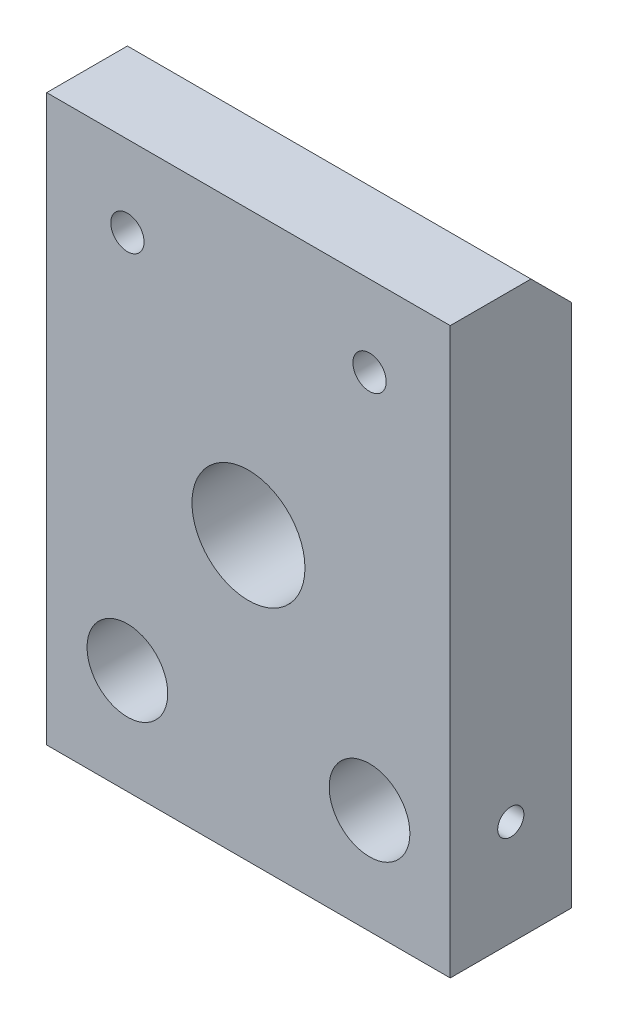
ISO-10303-21;
HEADER;
FILE_DESCRIPTION(('STEP AP214'),'2;1');
FILE_NAME('part.step','',(''),(''),'','','');
FILE_SCHEMA(('AUTOMOTIVE_DESIGN { 1 0 10303 214 1 1 1 1 }'));
ENDSEC;
DATA;
#1=APPLICATION_CONTEXT('core data for automotive mechanical design processes');
#2=APPLICATION_PROTOCOL_DEFINITION('international standard','automotive_design',2000,#1);
#3=PRODUCT_CONTEXT('',#1,'mechanical');
#4=PRODUCT('Part','Part','',(#3));
#5=PRODUCT_RELATED_PRODUCT_CATEGORY('part','',(#4));
#6=PRODUCT_DEFINITION_FORMATION('','',#4);
#7=PRODUCT_DEFINITION_CONTEXT('part definition',#1,'design');
#8=PRODUCT_DEFINITION('design','',#6,#7);
#9=PRODUCT_DEFINITION_SHAPE('','',#8);
#10=(LENGTH_UNIT() NAMED_UNIT(*) SI_UNIT(.MILLI.,.METRE.));
#11=(NAMED_UNIT(*) PLANE_ANGLE_UNIT() SI_UNIT($,.RADIAN.));
#12=(NAMED_UNIT(*) SI_UNIT($,.STERADIAN.) SOLID_ANGLE_UNIT());
#13=UNCERTAINTY_MEASURE_WITH_UNIT(LENGTH_MEASURE(1.E-05),#10,'distance_accuracy_value','');
#14=(GEOMETRIC_REPRESENTATION_CONTEXT(3) GLOBAL_UNCERTAINTY_ASSIGNED_CONTEXT((#13)) GLOBAL_UNIT_ASSIGNED_CONTEXT((#10,
#11,#12)) REPRESENTATION_CONTEXT('',''));
#15=CARTESIAN_POINT('',(0.,0.,0.));
#16=DIRECTION('',(0.,0.,1.));
#17=DIRECTION('',(1.,0.,0.));
#18=AXIS2_PLACEMENT_3D('',#15,#16,#17);
#19=CARTESIAN_POINT('',(-25.,0.,15.));
#20=DIRECTION('',(-1.,0.,0.));
#21=DIRECTION('',(0.,0.,1.));
#22=AXIS2_PLACEMENT_3D('',#19,#20,#21);
#23=PLANE('',#22);
#24=DIRECTION('',(0.,0.,-1.));
#25=VECTOR('',#24,1.);
#26=CARTESIAN_POINT('',(-25.,70.,15.));
#27=LINE('',#26,#25);
#28=CARTESIAN_POINT('',(-25.,70.,15.));
#29=VERTEX_POINT('',#28);
#30=CARTESIAN_POINT('',(-25.,70.,5.00000000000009));
#31=VERTEX_POINT('',#30);
#32=EDGE_CURVE('E84',#29,#31,#27,.T.);
#33=ORIENTED_EDGE('',*,*,#32,.T.);
#34=DIRECTION('',(0.,0.707106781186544,0.707106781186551));
#35=VECTOR('',#34,1.);
#36=CARTESIAN_POINT('',(-25.,40.0000000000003,-24.9999999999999));
#37=LINE('',#36,#35);
#38=CARTESIAN_POINT('',(-25.,65.,0.));
#39=VERTEX_POINT('',#38);
#40=EDGE_CURVE('E51',#31,#39,#37,.F.);
#41=ORIENTED_EDGE('',*,*,#40,.T.);
#42=DIRECTION('',(0.,1.,0.));
#43=VECTOR('',#42,1.);
#44=CARTESIAN_POINT('',(-25.,0.,0.));
#45=LINE('',#44,#43);
#46=CARTESIAN_POINT('',(-25.,0.,0.));
#47=VERTEX_POINT('',#46);
#48=EDGE_CURVE('E89',#47,#39,#45,.T.);
#49=ORIENTED_EDGE('',*,*,#48,.F.);
#50=DIRECTION('',(0.,0.,-1.));
#51=VECTOR('',#50,1.);
#52=CARTESIAN_POINT('',(-25.,0.,15.));
#53=LINE('',#52,#51);
#54=CARTESIAN_POINT('',(-25.,0.,15.));
#55=VERTEX_POINT('',#54);
#56=EDGE_CURVE('E75',#55,#47,#53,.T.);
#57=ORIENTED_EDGE('',*,*,#56,.F.);
#58=DIRECTION('',(0.,1.,0.));
#59=VECTOR('',#58,1.);
#60=CARTESIAN_POINT('',(-25.,0.,15.));
#61=LINE('',#60,#59);
#62=EDGE_CURVE('E103',#55,#29,#61,.T.);
#63=ORIENTED_EDGE('',*,*,#62,.T.);
#64=EDGE_LOOP('',(#33,#41,#49,#57,#63));
#65=FACE_BOUND('',#64,.T.);
#66=CARTESIAN_POINT('',(-25.,13.,7.5));
#67=DIRECTION('',(1.,0.,0.));
#68=DIRECTION('',(0.,0.,-1.));
#69=AXIS2_PLACEMENT_3D('',#66,#67,#68);
#70=CIRCLE('',#69,1.62);
#71=CARTESIAN_POINT('',(-25.,13.,5.88));
#72=VERTEX_POINT('',#71);
#73=EDGE_CURVE('E175',#72,#72,#70,.T.);
#74=ORIENTED_EDGE('',*,*,#73,.T.);
#75=EDGE_LOOP('',(#74));
#76=FACE_BOUND('',#75,.T.);
#77=ADVANCED_FACE('F29',(#65,#76),#23,.T.);
#78=CARTESIAN_POINT('',(-15.,13.,15.));
#79=DIRECTION('',(0.,0.,-1.));
#80=DIRECTION('',(-1.,0.,0.));
#81=AXIS2_PLACEMENT_3D('',#78,#79,#80);
#82=CYLINDRICAL_SURFACE('',#81,5.);
#83=CARTESIAN_POINT('',(-15.,13.,0.));
#84=DIRECTION('',(0.,0.,-1.));
#85=DIRECTION('',(-1.,0.,0.));
#86=AXIS2_PLACEMENT_3D('',#83,#84,#85);
#87=CIRCLE('',#86,5.);
#88=CARTESIAN_POINT('',(-20.,13.,0.));
#89=VERTEX_POINT('',#88);
#90=EDGE_CURVE('E195',#89,#89,#87,.T.);
#91=ORIENTED_EDGE('',*,*,#90,.T.);
#92=EDGE_LOOP('',(#91));
#93=FACE_BOUND('',#92,.T.);
#94=CARTESIAN_POINT('',(-15.,13.,15.));
#95=DIRECTION('',(0.,0.,-1.));
#96=DIRECTION('',(-1.,0.,0.));
#97=AXIS2_PLACEMENT_3D('',#94,#95,#96);
#98=CIRCLE('',#97,5.);
#99=CARTESIAN_POINT('',(-20.,13.,15.));
#100=VERTEX_POINT('',#99);
#101=EDGE_CURVE('E198',#100,#100,#98,.T.);
#102=ORIENTED_EDGE('',*,*,#101,.F.);
#103=EDGE_LOOP('',(#102));
#104=FACE_BOUND('',#103,.T.);
#105=CARTESIAN_POINT('',(-20.,13.,9.12));
#106=CARTESIAN_POINT('',(-19.9999999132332,13.0885311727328,9.11999994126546));
#107=CARTESIAN_POINT('',(-19.9976267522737,13.1770637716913,9.11271905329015));
#108=CARTESIAN_POINT('',(-19.9883929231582,13.3515296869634,9.08387115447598));
#109=CARTESIAN_POINT('',(-19.981531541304,13.4374625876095,9.06230187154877));
#110=CARTESIAN_POINT('',(-19.9640686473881,13.6041884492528,9.0056882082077));
#111=CARTESIAN_POINT('',(-19.9534731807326,13.684989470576,8.97066560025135));
#112=CARTESIAN_POINT('',(-19.9296292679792,13.8395714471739,8.8882352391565));
#113=CARTESIAN_POINT('',(-19.9163803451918,13.9133511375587,8.84082526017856));
#114=CARTESIAN_POINT('',(-19.8881412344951,14.0542263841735,8.73332419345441));
#115=CARTESIAN_POINT('',(-19.8731110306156,14.1210584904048,8.6728984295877));
#116=CARTESIAN_POINT('',(-19.8432287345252,14.2438393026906,8.54179306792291));
#117=CARTESIAN_POINT('',(-19.8283766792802,14.2997857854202,8.47111138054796));
#118=CARTESIAN_POINT('',(-19.8000969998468,14.400676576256,8.31917035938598));
#119=CARTESIAN_POINT('',(-19.7867184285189,14.4452845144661,8.23767766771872));
#120=CARTESIAN_POINT('',(-19.763505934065,14.5200509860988,8.06784344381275));
#121=CARTESIAN_POINT('',(-19.7536709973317,14.5502136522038,7.97950387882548));
#122=CARTESIAN_POINT('',(-19.7390794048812,14.5942560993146,7.80146921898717));
#123=CARTESIAN_POINT('',(-19.7341699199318,14.6086273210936,7.71190858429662));
#124=CARTESIAN_POINT('',(-19.7295322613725,14.6222148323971,7.53152309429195));
#125=CARTESIAN_POINT('',(-19.7298025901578,14.6214355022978,7.44069861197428));
#126=CARTESIAN_POINT('',(-19.7353596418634,14.6051268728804,7.2644966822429));
#127=CARTESIAN_POINT('',(-19.7404308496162,14.5902312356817,7.17905262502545));
#128=CARTESIAN_POINT('',(-19.7546667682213,14.547143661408,7.01194876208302));
#129=CARTESIAN_POINT('',(-19.7638319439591,14.5189502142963,6.93028938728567));
#130=CARTESIAN_POINT('',(-19.7853819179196,14.4496377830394,6.77160155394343));
#131=CARTESIAN_POINT('',(-19.797814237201,14.4083259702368,6.69466405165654));
#132=CARTESIAN_POINT('',(-19.8244769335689,14.3140833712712,6.54860962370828));
#133=CARTESIAN_POINT('',(-19.8387078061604,14.2611493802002,6.47949486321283));
#134=CARTESIAN_POINT('',(-19.8682196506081,14.1420916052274,6.3474771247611));
#135=CARTESIAN_POINT('',(-19.8835178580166,14.0754474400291,6.28504638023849));
#136=CARTESIAN_POINT('',(-19.9128265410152,13.9324460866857,6.17212771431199));
#137=CARTESIAN_POINT('',(-19.9268369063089,13.8560880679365,6.12164081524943));
#138=CARTESIAN_POINT('',(-19.9521579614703,13.6948667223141,6.03369051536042));
#139=CARTESIAN_POINT('',(-19.9634434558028,13.6099336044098,5.99634729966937));
#140=CARTESIAN_POINT('',(-19.9818608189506,13.4345389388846,5.93662203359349));
#141=CARTESIAN_POINT('',(-19.9889940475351,13.3440792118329,5.9142350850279));
#142=CARTESIAN_POINT('',(-19.9980808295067,13.1642017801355,5.88587976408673));
#143=CARTESIAN_POINT('',(-20.0002357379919,13.0748947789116,5.87927275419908));
#144=CARTESIAN_POINT('',(-19.999723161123,12.8964343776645,5.88085410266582));
#145=CARTESIAN_POINT('',(-19.9970564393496,12.8072809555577,5.88904011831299));
#146=CARTESIAN_POINT('',(-19.9873329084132,12.634172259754,5.91946633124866));
#147=CARTESIAN_POINT('',(-19.9803969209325,12.5501416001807,5.94131999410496));
#148=CARTESIAN_POINT('',(-19.9629558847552,12.3869684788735,5.99798318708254));
#149=CARTESIAN_POINT('',(-19.9524503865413,12.3078266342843,6.03279434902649));
#150=CARTESIAN_POINT('',(-19.9286102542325,12.1544332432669,6.1153711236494));
#151=CARTESIAN_POINT('',(-19.91521038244,12.0803575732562,6.16344407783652));
#152=CARTESIAN_POINT('',(-19.8871069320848,11.9411138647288,6.27081534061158));
#153=CARTESIAN_POINT('',(-19.8724029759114,11.8759484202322,6.33011690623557));
#154=CARTESIAN_POINT('',(-19.8425535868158,11.7534764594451,6.46126643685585));
#155=CARTESIAN_POINT('',(-19.8274161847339,11.6966255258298,6.5335426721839));
#156=CARTESIAN_POINT('',(-19.7990626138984,11.5958098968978,6.68693658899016));
#157=CARTESIAN_POINT('',(-19.7858464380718,11.5518451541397,6.76805423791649));
#158=CARTESIAN_POINT('',(-19.7629699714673,11.4782886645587,6.93676432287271));
#159=CARTESIAN_POINT('',(-19.7532992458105,11.4486546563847,7.0243368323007));
#160=CARTESIAN_POINT('',(-19.7387218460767,11.404674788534,7.20361108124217));
#161=CARTESIAN_POINT('',(-19.7338131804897,11.3903225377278,7.2953110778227));
#162=CARTESIAN_POINT('',(-19.7295336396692,11.3777945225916,7.47544545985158));
#163=CARTESIAN_POINT('',(-19.7299052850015,11.3788666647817,7.56382203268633));
#164=CARTESIAN_POINT('',(-19.7355129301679,11.395322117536,7.73906736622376));
#165=CARTESIAN_POINT('',(-19.7407486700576,11.410704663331,7.82593620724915));
#166=CARTESIAN_POINT('',(-19.755308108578,11.4548247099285,7.99424423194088));
#167=CARTESIAN_POINT('',(-19.7645610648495,11.4833315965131,8.07575045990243));
#168=CARTESIAN_POINT('',(-19.7860898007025,11.5527068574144,8.23288698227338));
#169=CARTESIAN_POINT('',(-19.798366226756,11.5935778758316,8.30851601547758));
#170=CARTESIAN_POINT('',(-19.8251957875,11.6885079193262,8.45516055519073));
#171=CARTESIAN_POINT('',(-19.8398224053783,11.7430449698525,8.52585310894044));
#172=CARTESIAN_POINT('',(-19.8693831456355,11.8629359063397,8.6573263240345));
#173=CARTESIAN_POINT('',(-19.8843173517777,11.9282927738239,8.71810424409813));
#174=CARTESIAN_POINT('',(-19.9134565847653,12.0707994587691,8.83022426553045));
#175=CARTESIAN_POINT('',(-19.9276159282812,12.1482894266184,8.88114731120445));
#176=CARTESIAN_POINT('',(-19.9530107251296,12.3111856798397,8.96918303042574));
#177=CARTESIAN_POINT('',(-19.9642471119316,12.3965894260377,9.0063001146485));
#178=CARTESIAN_POINT('',(-19.9819387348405,12.5673516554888,9.06358847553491));
#179=CARTESIAN_POINT('',(-19.9886500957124,12.6523755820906,9.08467823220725));
#180=CARTESIAN_POINT('',(-19.997680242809,12.824932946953,9.1128823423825));
#181=CARTESIAN_POINT('',(-20.0000000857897,12.912465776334,9.12000005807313));
#182=CARTESIAN_POINT('',(-20.,13.,9.12));
#183=B_SPLINE_CURVE_WITH_KNOTS('',3,(#105,#106,#107,#108,#109,#110,#111,#112,#113,#114,#115,
#116,#117,#118,#119,#120,#121,#122,#123,#124,#125,#126,#127,#128,#129,#130,#131,#132,#133,#134,
#135,#136,#137,#138,#139,#140,#141,#142,#143,#144,#145,#146,#147,#148,#149,#150,#151,#152,#153,
#154,#155,#156,#157,#158,#159,#160,#161,#162,#163,#164,#165,#166,#167,#168,#169,#170,#171,#172,
#173,#174,#175,#176,#177,#178,#179,#180,#181,#182),.UNSPECIFIED.,.T.,.F.,(4,2,2,2,2,2,2,2,2,2,2,
2,2,2,2,2,2,2,2,2,2,2,2,2,2,2,2,2,2,2,2,2,2,2,2,2,2,2,4),(0.,0.265271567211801,
0.530585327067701,0.795471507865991,1.06040531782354,1.33320409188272,1.60605852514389,
1.88625133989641,2.16636394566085,2.43748805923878,2.70853378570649,2.96796163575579,
3.22741895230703,3.49088184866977,3.75441748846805,4.03090513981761,4.30741644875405,
4.58639420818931,4.86528055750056,5.13267310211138,5.40002330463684,5.66013469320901,
5.92027885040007,6.18704828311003,6.45389521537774,6.73216017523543,7.01042411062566,
7.28786236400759,7.56518454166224,7.82903231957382,8.09286599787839,8.35223096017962,
8.61165142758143,8.88186734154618,9.15215784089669,9.43219049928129,9.71213361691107,
9.97448110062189,10.2367654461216),.UNSPECIFIED.);
#184=CARTESIAN_POINT('',(-20.,13.,9.12));
#185=VERTEX_POINT('',#184);
#186=EDGE_CURVE('E310',#185,#185,#183,.T.);
#187=ORIENTED_EDGE('',*,*,#186,.T.);
#188=EDGE_LOOP('',(#187));
#189=FACE_BOUND('',#188,.T.);
#190=ADVANCED_FACE('F143',(#93,#104,#189),#82,.F.);
#191=CARTESIAN_POINT('',(25.,70.,15.));
#192=DIRECTION('',(0.,0.,1.));
#193=DIRECTION('',(1.,0.,0.));
#194=AXIS2_PLACEMENT_3D('',#191,#192,#193);
#195=PLANE('',#194);
#196=CARTESIAN_POINT('',(15.,60.,15.));
#197=DIRECTION('',(0.,0.,-1.));
#198=DIRECTION('',(-1.,0.,0.));
#199=AXIS2_PLACEMENT_3D('',#196,#197,#198);
#200=CIRCLE('',#199,2.065);
#201=CARTESIAN_POINT('',(12.935,60.,15.));
#202=VERTEX_POINT('',#201);
#203=EDGE_CURVE('E172',#202,#202,#200,.T.);
#204=ORIENTED_EDGE('',*,*,#203,.T.);
#205=EDGE_LOOP('',(#204));
#206=FACE_BOUND('',#205,.T.);
#207=CARTESIAN_POINT('',(0.,35.,15.));
#208=DIRECTION('',(0.,0.,1.));
#209=DIRECTION('',(1.,0.,0.));
#210=AXIS2_PLACEMENT_3D('',#207,#208,#209);
#211=CIRCLE('',#210,7.);
#212=CARTESIAN_POINT('',(7.,35.,15.));
#213=VERTEX_POINT('',#212);
#214=EDGE_CURVE('E192',#213,#213,#211,.T.);
#215=ORIENTED_EDGE('',*,*,#214,.F.);
#216=EDGE_LOOP('',(#215));
#217=FACE_BOUND('',#216,.T.);
#218=ORIENTED_EDGE('',*,*,#101,.T.);
#219=EDGE_LOOP('',(#218));
#220=FACE_BOUND('',#219,.T.);
#221=DIRECTION('',(0.,1.,0.));
#222=VECTOR('',#221,1.);
#223=CARTESIAN_POINT('',(25.,0.,15.));
#224=LINE('',#223,#222);
#225=CARTESIAN_POINT('',(25.,0.,15.));
#226=VERTEX_POINT('',#225);
#227=CARTESIAN_POINT('',(25.,70.,15.));
#228=VERTEX_POINT('',#227);
#229=EDGE_CURVE('E91',#226,#228,#224,.T.);
#230=ORIENTED_EDGE('',*,*,#229,.T.);
#231=DIRECTION('',(-1.,0.,0.));
#232=VECTOR('',#231,1.);
#233=CARTESIAN_POINT('',(25.,70.,15.));
#234=LINE('',#233,#232);
#235=EDGE_CURVE('E101',#228,#29,#234,.T.);
#236=ORIENTED_EDGE('',*,*,#235,.T.);
#237=ORIENTED_EDGE('',*,*,#62,.F.);
#238=DIRECTION('',(1.,0.,0.));
#239=VECTOR('',#238,1.);
#240=CARTESIAN_POINT('',(-25.,0.,15.));
#241=LINE('',#240,#239);
#242=EDGE_CURVE('E81',#55,#226,#241,.T.);
#243=ORIENTED_EDGE('',*,*,#242,.T.);
#244=EDGE_LOOP('',(#230,#236,#237,#243));
#245=FACE_BOUND('',#244,.T.);
#246=CARTESIAN_POINT('',(15.,13.,15.));
#247=DIRECTION('',(0.,0.,1.));
#248=DIRECTION('',(1.,0.,0.));
#249=AXIS2_PLACEMENT_3D('',#246,#247,#248);
#250=CIRCLE('',#249,5.);
#251=CARTESIAN_POINT('',(20.,13.,15.));
#252=VERTEX_POINT('',#251);
#253=EDGE_CURVE('E95',#252,#252,#250,.T.);
#254=ORIENTED_EDGE('',*,*,#253,.F.);
#255=EDGE_LOOP('',(#254));
#256=FACE_BOUND('',#255,.T.);
#257=CARTESIAN_POINT('',(-15.,60.,15.));
#258=DIRECTION('',(0.,0.,1.));
#259=DIRECTION('',(1.,0.,0.));
#260=AXIS2_PLACEMENT_3D('',#257,#258,#259);
#261=CIRCLE('',#260,2.065);
#262=CARTESIAN_POINT('',(-12.935,60.,15.));
#263=VERTEX_POINT('',#262);
#264=EDGE_CURVE('E186',#263,#263,#261,.T.);
#265=ORIENTED_EDGE('',*,*,#264,.F.);
#266=EDGE_LOOP('',(#265));
#267=FACE_BOUND('',#266,.T.);
#268=ADVANCED_FACE('F122',(#206,#217,#220,#245,#256,#267),#195,.T.);
#269=CARTESIAN_POINT('',(25.,70.,0.));
#270=DIRECTION('',(0.,0.,1.));
#271=DIRECTION('',(1.,0.,0.));
#272=AXIS2_PLACEMENT_3D('',#269,#270,#271);
#273=PLANE('',#272);
#274=CARTESIAN_POINT('',(15.,60.,0.));
#275=DIRECTION('',(0.,0.,-1.));
#276=DIRECTION('',(-1.,0.,0.));
#277=AXIS2_PLACEMENT_3D('',#274,#275,#276);
#278=CIRCLE('',#277,2.065);
#279=CARTESIAN_POINT('',(12.935,60.,0.));
#280=VERTEX_POINT('',#279);
#281=EDGE_CURVE('E168',#280,#280,#278,.T.);
#282=ORIENTED_EDGE('',*,*,#281,.F.);
#283=EDGE_LOOP('',(#282));
#284=FACE_BOUND('',#283,.T.);
#285=CARTESIAN_POINT('',(0.,35.,0.));
#286=DIRECTION('',(0.,0.,1.));
#287=DIRECTION('',(1.,0.,0.));
#288=AXIS2_PLACEMENT_3D('',#285,#286,#287);
#289=CIRCLE('',#288,7.);
#290=CARTESIAN_POINT('',(7.,35.,0.));
#291=VERTEX_POINT('',#290);
#292=EDGE_CURVE('E189',#291,#291,#289,.T.);
#293=ORIENTED_EDGE('',*,*,#292,.T.);
#294=EDGE_LOOP('',(#293));
#295=FACE_BOUND('',#294,.T.);
#296=ORIENTED_EDGE('',*,*,#90,.F.);
#297=EDGE_LOOP('',(#296));
#298=FACE_BOUND('',#297,.T.);
#299=ORIENTED_EDGE('',*,*,#48,.T.);
#300=DIRECTION('',(1.,0.,0.));
#301=VECTOR('',#300,1.);
#302=CARTESIAN_POINT('',(25.,65.,0.));
#303=LINE('',#302,#301);
#304=CARTESIAN_POINT('',(25.,65.,0.));
#305=VERTEX_POINT('',#304);
#306=EDGE_CURVE('E37',#39,#305,#303,.T.);
#307=ORIENTED_EDGE('',*,*,#306,.T.);
#308=DIRECTION('',(0.,1.,0.));
#309=VECTOR('',#308,1.);
#310=CARTESIAN_POINT('',(25.,0.,0.));
#311=LINE('',#310,#309);
#312=CARTESIAN_POINT('',(25.,0.,0.));
#313=VERTEX_POINT('',#312);
#314=EDGE_CURVE('E90',#313,#305,#311,.T.);
#315=ORIENTED_EDGE('',*,*,#314,.F.);
#316=DIRECTION('',(1.,0.,0.));
#317=VECTOR('',#316,1.);
#318=CARTESIAN_POINT('',(-25.,0.,0.));
#319=LINE('',#318,#317);
#320=EDGE_CURVE('E79',#47,#313,#319,.T.);
#321=ORIENTED_EDGE('',*,*,#320,.F.);
#322=EDGE_LOOP('',(#299,#307,#315,#321));
#323=FACE_BOUND('',#322,.T.);
#324=CARTESIAN_POINT('',(15.,13.,0.));
#325=DIRECTION('',(0.,0.,1.));
#326=DIRECTION('',(1.,0.,0.));
#327=AXIS2_PLACEMENT_3D('',#324,#325,#326);
#328=CIRCLE('',#327,5.);
#329=CARTESIAN_POINT('',(20.,13.,0.));
#330=VERTEX_POINT('',#329);
#331=EDGE_CURVE('E201',#330,#330,#328,.T.);
#332=ORIENTED_EDGE('',*,*,#331,.T.);
#333=EDGE_LOOP('',(#332));
#334=FACE_BOUND('',#333,.T.);
#335=CARTESIAN_POINT('',(-15.,60.,0.));
#336=DIRECTION('',(0.,0.,1.));
#337=DIRECTION('',(1.,0.,0.));
#338=AXIS2_PLACEMENT_3D('',#335,#336,#337);
#339=CIRCLE('',#338,2.065);
#340=CARTESIAN_POINT('',(-12.935,60.,0.));
#341=VERTEX_POINT('',#340);
#342=EDGE_CURVE('E183',#341,#341,#339,.T.);
#343=ORIENTED_EDGE('',*,*,#342,.T.);
#344=EDGE_LOOP('',(#343));
#345=FACE_BOUND('',#344,.T.);
#346=ADVANCED_FACE('F87',(#284,#295,#298,#323,#334,#345),#273,.F.);
#347=CARTESIAN_POINT('',(25.,0.,15.));
#348=DIRECTION('',(-1.,0.,0.));
#349=DIRECTION('',(0.,0.,1.));
#350=AXIS2_PLACEMENT_3D('',#347,#348,#349);
#351=PLANE('',#350);
#352=CARTESIAN_POINT('',(25.,13.,7.5));
#353=DIRECTION('',(1.,0.,0.));
#354=DIRECTION('',(0.,0.,-1.));
#355=AXIS2_PLACEMENT_3D('',#352,#353,#354);
#356=CIRCLE('',#355,1.62);
#357=CARTESIAN_POINT('',(25.,13.,5.88));
#358=VERTEX_POINT('',#357);
#359=EDGE_CURVE('E166',#358,#358,#356,.T.);
#360=ORIENTED_EDGE('',*,*,#359,.F.);
#361=EDGE_LOOP('',(#360));
#362=FACE_BOUND('',#361,.T.);
#363=ORIENTED_EDGE('',*,*,#314,.T.);
#364=DIRECTION('',(0.,-0.707106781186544,-0.707106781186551));
#365=VECTOR('',#364,1.);
#366=CARTESIAN_POINT('',(25.,70.,5.00000000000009));
#367=LINE('',#366,#365);
#368=CARTESIAN_POINT('',(25.,70.,5.00000000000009));
#369=VERTEX_POINT('',#368);
#370=EDGE_CURVE('E11',#305,#369,#367,.F.);
#371=ORIENTED_EDGE('',*,*,#370,.T.);
#372=DIRECTION('',(0.,0.,-1.));
#373=VECTOR('',#372,1.);
#374=CARTESIAN_POINT('',(25.,70.,15.));
#375=LINE('',#374,#373);
#376=EDGE_CURVE('E108',#228,#369,#375,.T.);
#377=ORIENTED_EDGE('',*,*,#376,.F.);
#378=ORIENTED_EDGE('',*,*,#229,.F.);
#379=DIRECTION('',(0.,0.,-1.));
#380=VECTOR('',#379,1.);
#381=CARTESIAN_POINT('',(25.,0.,15.));
#382=LINE('',#381,#380);
#383=EDGE_CURVE('E85',#226,#313,#382,.T.);
#384=ORIENTED_EDGE('',*,*,#383,.T.);
#385=EDGE_LOOP('',(#363,#371,#377,#378,#384));
#386=FACE_BOUND('',#385,.T.);
#387=ADVANCED_FACE('F31',(#362,#386),#351,.F.);
#388=CARTESIAN_POINT('',(25.,70.,15.));
#389=DIRECTION('',(0.,-1.,0.));
#390=DIRECTION('',(0.,0.,-1.));
#391=AXIS2_PLACEMENT_3D('',#388,#389,#390);
#392=PLANE('',#391);
#393=ORIENTED_EDGE('',*,*,#376,.T.);
#394=DIRECTION('',(-1.,0.,0.));
#395=VECTOR('',#394,1.);
#396=CARTESIAN_POINT('',(25.,70.,5.00000000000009));
#397=LINE('',#396,#395);
#398=EDGE_CURVE('E111',#369,#31,#397,.T.);
#399=ORIENTED_EDGE('',*,*,#398,.T.);
#400=ORIENTED_EDGE('',*,*,#32,.F.);
#401=ORIENTED_EDGE('',*,*,#235,.F.);
#402=EDGE_LOOP('',(#393,#399,#400,#401));
#403=FACE_BOUND('',#402,.T.);
#404=ADVANCED_FACE('F117',(#403),#392,.F.);
#405=CARTESIAN_POINT('',(-25.,0.,15.));
#406=DIRECTION('',(0.,1.,0.));
#407=DIRECTION('',(0.,0.,1.));
#408=AXIS2_PLACEMENT_3D('',#405,#406,#407);
#409=PLANE('',#408);
#410=ORIENTED_EDGE('',*,*,#320,.T.);
#411=ORIENTED_EDGE('',*,*,#383,.F.);
#412=ORIENTED_EDGE('',*,*,#242,.F.);
#413=ORIENTED_EDGE('',*,*,#56,.T.);
#414=EDGE_LOOP('',(#410,#411,#412,#413));
#415=FACE_BOUND('',#414,.T.);
#416=ADVANCED_FACE('F77',(#415),#409,.F.);
#417=CARTESIAN_POINT('',(15.,13.,15.));
#418=DIRECTION('',(0.,0.,-1.));
#419=DIRECTION('',(-1.,0.,0.));
#420=AXIS2_PLACEMENT_3D('',#417,#418,#419);
#421=CYLINDRICAL_SURFACE('',#420,5.);
#422=CARTESIAN_POINT('',(20.,13.,5.88));
#423=CARTESIAN_POINT('',(19.9999999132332,13.0885311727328,5.88000005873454));
#424=CARTESIAN_POINT('',(19.9976267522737,13.1770637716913,5.88728094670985));
#425=CARTESIAN_POINT('',(19.9883929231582,13.3515296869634,5.91612884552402));
#426=CARTESIAN_POINT('',(19.981531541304,13.4374625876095,5.93769812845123));
#427=CARTESIAN_POINT('',(19.9640686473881,13.6041884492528,5.9943117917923));
#428=CARTESIAN_POINT('',(19.9534731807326,13.684989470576,6.02933439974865));
#429=CARTESIAN_POINT('',(19.9296292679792,13.8395714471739,6.1117647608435));
#430=CARTESIAN_POINT('',(19.9163803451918,13.9133511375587,6.15917473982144));
#431=CARTESIAN_POINT('',(19.8881412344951,14.0542263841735,6.26667580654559));
#432=CARTESIAN_POINT('',(19.8731110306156,14.1210584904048,6.3271015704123));
#433=CARTESIAN_POINT('',(19.8432287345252,14.2438393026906,6.45820693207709));
#434=CARTESIAN_POINT('',(19.8283766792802,14.2997857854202,6.52888861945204));
#435=CARTESIAN_POINT('',(19.8000969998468,14.400676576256,6.68082964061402));
#436=CARTESIAN_POINT('',(19.7867184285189,14.4452845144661,6.76232233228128));
#437=CARTESIAN_POINT('',(19.763505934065,14.5200509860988,6.93215655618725));
#438=CARTESIAN_POINT('',(19.7536709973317,14.5502136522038,7.02049612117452));
#439=CARTESIAN_POINT('',(19.7390794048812,14.5942560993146,7.19853078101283));
#440=CARTESIAN_POINT('',(19.7341699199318,14.6086273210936,7.28809141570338));
#441=CARTESIAN_POINT('',(19.7295322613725,14.6222148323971,7.46847690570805));
#442=CARTESIAN_POINT('',(19.7298025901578,14.6214355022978,7.55930138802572));
#443=CARTESIAN_POINT('',(19.7353596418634,14.6051268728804,7.7355033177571));
#444=CARTESIAN_POINT('',(19.7404308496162,14.5902312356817,7.82094737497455));
#445=CARTESIAN_POINT('',(19.7546667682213,14.547143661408,7.98805123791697));
#446=CARTESIAN_POINT('',(19.7638319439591,14.5189502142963,8.06971061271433));
#447=CARTESIAN_POINT('',(19.7853819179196,14.4496377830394,8.22839844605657));
#448=CARTESIAN_POINT('',(19.797814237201,14.4083259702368,8.30533594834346));
#449=CARTESIAN_POINT('',(19.8244769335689,14.3140833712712,8.45139037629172));
#450=CARTESIAN_POINT('',(19.8387078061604,14.2611493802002,8.52050513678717));
#451=CARTESIAN_POINT('',(19.8682196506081,14.1420916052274,8.6525228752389));
#452=CARTESIAN_POINT('',(19.8835178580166,14.0754474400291,8.71495361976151));
#453=CARTESIAN_POINT('',(19.9128265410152,13.9324460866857,8.82787228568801));
#454=CARTESIAN_POINT('',(19.9268369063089,13.8560880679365,8.87835918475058));
#455=CARTESIAN_POINT('',(19.9521579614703,13.6948667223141,8.96630948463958));
#456=CARTESIAN_POINT('',(19.9634434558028,13.6099336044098,9.00365270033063));
#457=CARTESIAN_POINT('',(19.9818608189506,13.4345389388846,9.06337796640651));
#458=CARTESIAN_POINT('',(19.9889940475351,13.3440792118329,9.0857649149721));
#459=CARTESIAN_POINT('',(19.9980808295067,13.1642017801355,9.11412023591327));
#460=CARTESIAN_POINT('',(20.0002357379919,13.0748947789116,9.12072724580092));
#461=CARTESIAN_POINT('',(19.999723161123,12.8964343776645,9.11914589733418));
#462=CARTESIAN_POINT('',(19.9970564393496,12.8072809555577,9.11095988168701));
#463=CARTESIAN_POINT('',(19.9873329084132,12.634172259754,9.08053366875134));
#464=CARTESIAN_POINT('',(19.9803969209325,12.5501416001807,9.05868000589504));
#465=CARTESIAN_POINT('',(19.9629558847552,12.3869684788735,9.00201681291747));
#466=CARTESIAN_POINT('',(19.9524503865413,12.3078266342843,8.96720565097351));
#467=CARTESIAN_POINT('',(19.9286102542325,12.1544332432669,8.8846288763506));
#468=CARTESIAN_POINT('',(19.91521038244,12.0803575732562,8.83655592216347));
#469=CARTESIAN_POINT('',(19.8871069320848,11.9411138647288,8.72918465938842));
#470=CARTESIAN_POINT('',(19.8724029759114,11.8759484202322,8.66988309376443));
#471=CARTESIAN_POINT('',(19.8425535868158,11.7534764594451,8.53873356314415));
#472=CARTESIAN_POINT('',(19.8274161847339,11.6966255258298,8.4664573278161));
#473=CARTESIAN_POINT('',(19.7990626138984,11.5958098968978,8.31306341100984));
#474=CARTESIAN_POINT('',(19.7858464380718,11.5518451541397,8.23194576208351));
#475=CARTESIAN_POINT('',(19.7629699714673,11.4782886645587,8.06323567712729));
#476=CARTESIAN_POINT('',(19.7532992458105,11.4486546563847,7.9756631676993));
#477=CARTESIAN_POINT('',(19.7387218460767,11.404674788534,7.79638891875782));
#478=CARTESIAN_POINT('',(19.7338131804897,11.3903225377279,7.7046889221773));
#479=CARTESIAN_POINT('',(19.7295336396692,11.3777945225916,7.52455454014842));
#480=CARTESIAN_POINT('',(19.7299052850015,11.3788666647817,7.43617796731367));
#481=CARTESIAN_POINT('',(19.7355129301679,11.395322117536,7.26093263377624));
#482=CARTESIAN_POINT('',(19.7407486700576,11.410704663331,7.17406379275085));
#483=CARTESIAN_POINT('',(19.755308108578,11.4548247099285,7.00575576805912));
#484=CARTESIAN_POINT('',(19.7645610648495,11.4833315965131,6.92424954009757));
#485=CARTESIAN_POINT('',(19.7860898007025,11.5527068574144,6.76711301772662));
#486=CARTESIAN_POINT('',(19.798366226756,11.5935778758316,6.69148398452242));
#487=CARTESIAN_POINT('',(19.8251957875,11.6885079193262,6.54483944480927));
#488=CARTESIAN_POINT('',(19.8398224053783,11.7430449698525,6.47414689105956));
#489=CARTESIAN_POINT('',(19.8693831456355,11.8629359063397,6.3426736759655));
#490=CARTESIAN_POINT('',(19.8843173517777,11.9282927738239,6.28189575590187));
#491=CARTESIAN_POINT('',(19.9134565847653,12.0707994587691,6.16977573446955));
#492=CARTESIAN_POINT('',(19.9276159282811,12.1482894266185,6.11885268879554));
#493=CARTESIAN_POINT('',(19.9530107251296,12.3111856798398,6.03081696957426));
#494=CARTESIAN_POINT('',(19.9642471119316,12.3965894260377,5.9936998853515));
#495=CARTESIAN_POINT('',(19.9819387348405,12.5673516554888,5.93641152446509));
#496=CARTESIAN_POINT('',(19.9886500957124,12.6523755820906,5.91532176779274));
#497=CARTESIAN_POINT('',(19.997680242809,12.824932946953,5.8871176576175));
#498=CARTESIAN_POINT('',(20.0000000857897,12.912465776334,5.87999994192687));
#499=CARTESIAN_POINT('',(20.,13.,5.88));
#500=B_SPLINE_CURVE_WITH_KNOTS('',3,(#422,#423,#424,#425,#426,#427,#428,#429,#430,#431,#432,
#433,#434,#435,#436,#437,#438,#439,#440,#441,#442,#443,#444,#445,#446,#447,#448,#449,#450,#451,
#452,#453,#454,#455,#456,#457,#458,#459,#460,#461,#462,#463,#464,#465,#466,#467,#468,#469,#470,
#471,#472,#473,#474,#475,#476,#477,#478,#479,#480,#481,#482,#483,#484,#485,#486,#487,#488,#489,
#490,#491,#492,#493,#494,#495,#496,#497,#498,#499),.UNSPECIFIED.,.T.,.F.,(4,2,2,2,2,2,2,2,2,2,2,
2,2,2,2,2,2,2,2,2,2,2,2,2,2,2,2,2,2,2,2,2,2,2,2,2,2,2,4),(0.,0.265271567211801,
0.530585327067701,0.795471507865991,1.06040531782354,1.33320409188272,1.60605852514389,
1.88625133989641,2.16636394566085,2.43748805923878,2.70853378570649,2.96796163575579,
3.22741895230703,3.49088184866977,3.75441748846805,4.03090513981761,4.30741644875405,
4.58639420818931,4.86528055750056,5.13267310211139,5.40002330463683,5.66013469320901,
5.92027885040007,6.18704828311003,6.45389521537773,6.73216017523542,7.01042411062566,
7.28786236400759,7.56518454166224,7.82903231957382,8.09286599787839,8.35223096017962,
8.61165142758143,8.88186734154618,9.15215784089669,9.43219049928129,9.71213361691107,
9.97448110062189,10.2367654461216),.UNSPECIFIED.);
#501=CARTESIAN_POINT('',(20.,13.,5.88));
#502=VERTEX_POINT('',#501);
#503=EDGE_CURVE('E169',#502,#502,#500,.T.);
#504=ORIENTED_EDGE('',*,*,#503,.T.);
#505=EDGE_LOOP('',(#504));
#506=FACE_BOUND('',#505,.T.);
#507=ORIENTED_EDGE('',*,*,#253,.T.);
#508=EDGE_LOOP('',(#507));
#509=FACE_BOUND('',#508,.T.);
#510=ORIENTED_EDGE('',*,*,#331,.F.);
#511=EDGE_LOOP('',(#510));
#512=FACE_BOUND('',#511,.T.);
#513=ADVANCED_FACE('F157',(#506,#509,#512),#421,.F.);
#514=CARTESIAN_POINT('',(0.,35.,15.));
#515=DIRECTION('',(0.,0.,-1.));
#516=DIRECTION('',(-1.,0.,0.));
#517=AXIS2_PLACEMENT_3D('',#514,#515,#516);
#518=CYLINDRICAL_SURFACE('',#517,7.);
#519=ORIENTED_EDGE('',*,*,#214,.T.);
#520=EDGE_LOOP('',(#519));
#521=FACE_BOUND('',#520,.T.);
#522=ORIENTED_EDGE('',*,*,#292,.F.);
#523=EDGE_LOOP('',(#522));
#524=FACE_BOUND('',#523,.T.);
#525=ADVANCED_FACE('F214',(#521,#524),#518,.F.);
#526=CARTESIAN_POINT('',(-15.,60.,15.));
#527=DIRECTION('',(0.,0.,-1.));
#528=DIRECTION('',(-1.,0.,0.));
#529=AXIS2_PLACEMENT_3D('',#526,#527,#528);
#530=CYLINDRICAL_SURFACE('',#529,2.065);
#531=ORIENTED_EDGE('',*,*,#264,.T.);
#532=EDGE_LOOP('',(#531));
#533=FACE_BOUND('',#532,.T.);
#534=ORIENTED_EDGE('',*,*,#342,.F.);
#535=EDGE_LOOP('',(#534));
#536=FACE_BOUND('',#535,.T.);
#537=ADVANCED_FACE('F138',(#533,#536),#530,.F.);
#538=CARTESIAN_POINT('',(15.,60.,15.));
#539=DIRECTION('',(0.,0.,-1.));
#540=DIRECTION('',(-1.,0.,0.));
#541=AXIS2_PLACEMENT_3D('',#538,#539,#540);
#542=CYLINDRICAL_SURFACE('',#541,2.065);
#543=ORIENTED_EDGE('',*,*,#203,.F.);
#544=EDGE_LOOP('',(#543));
#545=FACE_BOUND('',#544,.T.);
#546=ORIENTED_EDGE('',*,*,#281,.T.);
#547=EDGE_LOOP('',(#546));
#548=FACE_BOUND('',#547,.T.);
#549=ADVANCED_FACE('F129',(#545,#548),#542,.F.);
#550=CARTESIAN_POINT('',(25.,70.,5.00000000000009));
#551=DIRECTION('',(0.,-0.707106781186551,0.707106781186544));
#552=DIRECTION('',(0.,-0.707106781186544,-0.707106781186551));
#553=AXIS2_PLACEMENT_3D('',#550,#551,#552);
#554=PLANE('',#553);
#555=ORIENTED_EDGE('',*,*,#370,.F.);
#556=ORIENTED_EDGE('',*,*,#306,.F.);
#557=ORIENTED_EDGE('',*,*,#40,.F.);
#558=ORIENTED_EDGE('',*,*,#398,.F.);
#559=EDGE_LOOP('',(#555,#556,#557,#558));
#560=FACE_BOUND('',#559,.T.);
#561=ADVANCED_FACE('F126',(#560),#554,.F.);
#562=CARTESIAN_POINT('',(-25.001,13.,7.5));
#563=DIRECTION('',(1.,0.,0.));
#564=DIRECTION('',(0.,0.,-1.));
#565=AXIS2_PLACEMENT_3D('',#562,#563,#564);
#566=CYLINDRICAL_SURFACE('',#565,1.62);
#567=ORIENTED_EDGE('',*,*,#503,.F.);
#568=EDGE_LOOP('',(#567));
#569=FACE_BOUND('',#568,.T.);
#570=ORIENTED_EDGE('',*,*,#359,.T.);
#571=EDGE_LOOP('',(#570));
#572=FACE_BOUND('',#571,.T.);
#573=ADVANCED_FACE('F128',(#569,#572),#566,.F.);
#574=CARTESIAN_POINT('',(25.001,13.,7.5));
#575=DIRECTION('',(-1.,0.,0.));
#576=DIRECTION('',(0.,0.,1.));
#577=AXIS2_PLACEMENT_3D('',#574,#575,#576);
#578=CYLINDRICAL_SURFACE('',#577,1.62);
#579=ORIENTED_EDGE('',*,*,#73,.F.);
#580=EDGE_LOOP('',(#579));
#581=FACE_BOUND('',#580,.T.);
#582=ORIENTED_EDGE('',*,*,#186,.F.);
#583=EDGE_LOOP('',(#582));
#584=FACE_BOUND('',#583,.T.);
#585=ADVANCED_FACE('F135',(#581,#584),#578,.F.);
#586=CLOSED_SHELL('',(#77,#190,#268,#346,#387,#404,#416,#513,#525,#537,#549,#561,#573,#585));
#587=MANIFOLD_SOLID_BREP('B2',#586);
#588=ADVANCED_BREP_SHAPE_REPRESENTATION('',(#18,#587),#14);
#589=SHAPE_DEFINITION_REPRESENTATION(#9,#588);
ENDSEC;
END-ISO-10303-21;
